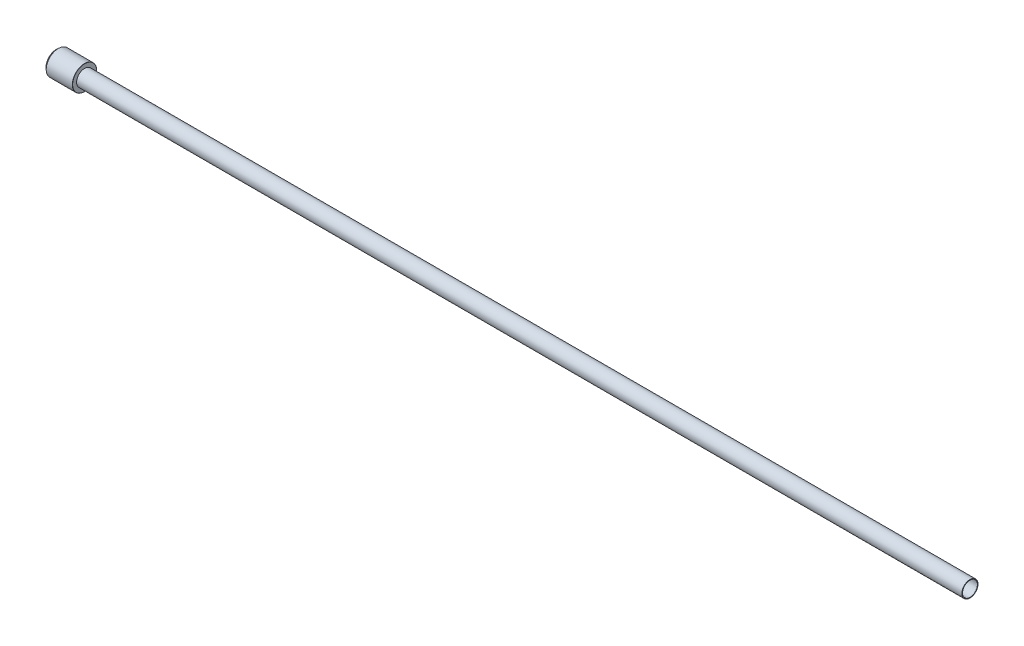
ISO-10303-21;
HEADER;
FILE_DESCRIPTION(('STEP AP214'),'2;1');
FILE_NAME('part.step','',(''),(''),'','','');
FILE_SCHEMA(('AUTOMOTIVE_DESIGN { 1 0 10303 214 1 1 1 1 }'));
ENDSEC;
DATA;
#1=APPLICATION_CONTEXT('core data for automotive mechanical design processes');
#2=APPLICATION_PROTOCOL_DEFINITION('international standard','automotive_design',2000,#1);
#3=PRODUCT_CONTEXT('',#1,'mechanical');
#4=PRODUCT('Part','Part','',(#3));
#5=PRODUCT_RELATED_PRODUCT_CATEGORY('part','',(#4));
#6=PRODUCT_DEFINITION_FORMATION('','',#4);
#7=PRODUCT_DEFINITION_CONTEXT('part definition',#1,'design');
#8=PRODUCT_DEFINITION('design','',#6,#7);
#9=PRODUCT_DEFINITION_SHAPE('','',#8);
#10=(LENGTH_UNIT() NAMED_UNIT(*) SI_UNIT(.MILLI.,.METRE.));
#11=(NAMED_UNIT(*) PLANE_ANGLE_UNIT() SI_UNIT($,.RADIAN.));
#12=(NAMED_UNIT(*) SI_UNIT($,.STERADIAN.) SOLID_ANGLE_UNIT());
#13=UNCERTAINTY_MEASURE_WITH_UNIT(LENGTH_MEASURE(1.E-05),#10,'distance_accuracy_value','');
#14=(GEOMETRIC_REPRESENTATION_CONTEXT(3) GLOBAL_UNCERTAINTY_ASSIGNED_CONTEXT((#13)) GLOBAL_UNIT_ASSIGNED_CONTEXT((#10,
#11,#12)) REPRESENTATION_CONTEXT('',''));
#15=CARTESIAN_POINT('',(0.,0.,0.));
#16=DIRECTION('',(0.,0.,1.));
#17=DIRECTION('',(1.,0.,0.));
#18=AXIS2_PLACEMENT_3D('',#15,#16,#17);
#19=CARTESIAN_POINT('',(14.,6.,0.));
#20=DIRECTION('',(-1.,0.,0.));
#21=DIRECTION('',(0.,0.,1.));
#22=AXIS2_PLACEMENT_3D('',#19,#20,#21);
#23=PLANE('',#22);
#24=CARTESIAN_POINT('',(14.,0.,0.));
#25=DIRECTION('',(-1.,0.,0.));
#26=DIRECTION('',(0.,0.,1.));
#27=AXIS2_PLACEMENT_3D('',#24,#25,#26);
#28=CIRCLE('',#27,5.9);
#29=CARTESIAN_POINT('',(14.,0.,5.9));
#30=VERTEX_POINT('',#29);
#31=EDGE_CURVE('E10',#30,#30,#28,.F.);
#32=ORIENTED_EDGE('',*,*,#31,.T.);
#33=EDGE_LOOP('',(#32));
#34=FACE_BOUND('',#33,.T.);
#35=CARTESIAN_POINT('',(14.,0.,0.));
#36=DIRECTION('',(-1.,0.,0.));
#37=DIRECTION('',(0.,0.,1.));
#38=AXIS2_PLACEMENT_3D('',#35,#36,#37);
#39=CIRCLE('',#38,3.9751);
#40=CARTESIAN_POINT('',(14.,0.,3.9751));
#41=VERTEX_POINT('',#40);
#42=EDGE_CURVE('E62',#41,#41,#39,.T.);
#43=ORIENTED_EDGE('',*,*,#42,.T.);
#44=EDGE_LOOP('',(#43));
#45=FACE_BOUND('',#44,.T.);
#46=ADVANCED_FACE('F30',(#34,#45),#23,.F.);
#47=CARTESIAN_POINT('',(-22.2121854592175,0.,0.));
#48=DIRECTION('',(-1.,0.,0.));
#49=DIRECTION('',(0.,0.,1.));
#50=AXIS2_PLACEMENT_3D('',#47,#48,#49);
#51=CYLINDRICAL_SURFACE('',#50,6.);
#52=CARTESIAN_POINT('',(13.9,0.,0.));
#53=DIRECTION('',(-1.,0.,0.));
#54=DIRECTION('',(0.,0.,1.));
#55=AXIS2_PLACEMENT_3D('',#52,#53,#54);
#56=CIRCLE('',#55,6.);
#57=CARTESIAN_POINT('',(13.9,0.,6.));
#58=VERTEX_POINT('',#57);
#59=EDGE_CURVE('E37',#58,#58,#56,.T.);
#60=ORIENTED_EDGE('',*,*,#59,.T.);
#61=EDGE_LOOP('',(#60));
#62=FACE_BOUND('',#61,.T.);
#63=CARTESIAN_POINT('',(1.064,0.,0.));
#64=DIRECTION('',(-1.,0.,0.));
#65=DIRECTION('',(0.,0.,1.));
#66=AXIS2_PLACEMENT_3D('',#63,#64,#65);
#67=CIRCLE('',#66,6.);
#68=CARTESIAN_POINT('',(1.064,0.,6.));
#69=VERTEX_POINT('',#68);
#70=EDGE_CURVE('E41',#69,#69,#67,.T.);
#71=ORIENTED_EDGE('',*,*,#70,.F.);
#72=EDGE_LOOP('',(#71));
#73=FACE_BOUND('',#72,.T.);
#74=ADVANCED_FACE('F100',(#62,#73),#51,.T.);
#75=CARTESIAN_POINT('',(1.064,0.,0.));
#76=DIRECTION('',(1.,0.,0.));
#77=DIRECTION('',(0.,0.,-1.));
#78=AXIS2_PLACEMENT_3D('',#75,#76,#77);
#79=CONICAL_SURFACE('',#78,6.,0.785398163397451);
#80=CARTESIAN_POINT('',(0.0999999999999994,0.,0.));
#81=DIRECTION('',(-1.,0.,0.));
#82=DIRECTION('',(0.,0.,1.));
#83=AXIS2_PLACEMENT_3D('',#80,#81,#82);
#84=CIRCLE('',#83,5.036);
#85=CARTESIAN_POINT('',(0.0999999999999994,0.,5.036));
#86=VERTEX_POINT('',#85);
#87=EDGE_CURVE('E45',#86,#86,#84,.T.);
#88=ORIENTED_EDGE('',*,*,#87,.F.);
#89=EDGE_LOOP('',(#88));
#90=FACE_BOUND('',#89,.T.);
#91=ORIENTED_EDGE('',*,*,#70,.T.);
#92=EDGE_LOOP('',(#91));
#93=FACE_BOUND('',#92,.T.);
#94=ADVANCED_FACE('F94',(#90,#93),#79,.T.);
#95=CARTESIAN_POINT('',(-22.2121854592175,0.,0.));
#96=DIRECTION('',(-1.,0.,0.));
#97=DIRECTION('',(0.,0.,1.));
#98=AXIS2_PLACEMENT_3D('',#95,#96,#97);
#99=CYLINDRICAL_SURFACE('',#98,5.036);
#100=CARTESIAN_POINT('',(0.,0.,0.));
#101=DIRECTION('',(-1.,0.,0.));
#102=DIRECTION('',(0.,0.,1.));
#103=AXIS2_PLACEMENT_3D('',#100,#101,#102);
#104=CIRCLE('',#103,5.036);
#105=CARTESIAN_POINT('',(0.,0.,5.036));
#106=VERTEX_POINT('',#105);
#107=EDGE_CURVE('E50',#106,#106,#104,.T.);
#108=ORIENTED_EDGE('',*,*,#107,.F.);
#109=EDGE_LOOP('',(#108));
#110=FACE_BOUND('',#109,.T.);
#111=ORIENTED_EDGE('',*,*,#87,.T.);
#112=EDGE_LOOP('',(#111));
#113=FACE_BOUND('',#112,.T.);
#114=ADVANCED_FACE('F88',(#110,#113),#99,.T.);
#115=CARTESIAN_POINT('',(0.,3.6576,0.));
#116=DIRECTION('',(1.,0.,0.));
#117=DIRECTION('',(0.,0.,-1.));
#118=AXIS2_PLACEMENT_3D('',#115,#116,#117);
#119=PLANE('',#118);
#120=CARTESIAN_POINT('',(0.,0.,0.));
#121=DIRECTION('',(-1.,0.,0.));
#122=DIRECTION('',(0.,0.,1.));
#123=AXIS2_PLACEMENT_3D('',#120,#121,#122);
#124=CIRCLE('',#123,3.6576);
#125=CARTESIAN_POINT('',(0.,0.,3.6576));
#126=VERTEX_POINT('',#125);
#127=EDGE_CURVE('E53',#126,#126,#124,.T.);
#128=ORIENTED_EDGE('',*,*,#127,.F.);
#129=EDGE_LOOP('',(#128));
#130=FACE_BOUND('',#129,.T.);
#131=ORIENTED_EDGE('',*,*,#107,.T.);
#132=EDGE_LOOP('',(#131));
#133=FACE_BOUND('',#132,.T.);
#134=ADVANCED_FACE('F82',(#130,#133),#119,.F.);
#135=CARTESIAN_POINT('',(-22.2121854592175,0.,0.));
#136=DIRECTION('',(-1.,0.,0.));
#137=DIRECTION('',(0.,0.,1.));
#138=AXIS2_PLACEMENT_3D('',#135,#136,#137);
#139=CYLINDRICAL_SURFACE('',#138,3.65760000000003);
#140=CARTESIAN_POINT('',(450.,0.,0.));
#141=DIRECTION('',(-1.,0.,0.));
#142=DIRECTION('',(0.,0.,1.));
#143=AXIS2_PLACEMENT_3D('',#140,#141,#142);
#144=CIRCLE('',#143,3.65760000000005);
#145=CARTESIAN_POINT('',(450.,0.,3.65760000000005));
#146=VERTEX_POINT('',#145);
#147=EDGE_CURVE('E56',#146,#146,#144,.T.);
#148=ORIENTED_EDGE('',*,*,#147,.F.);
#149=EDGE_LOOP('',(#148));
#150=FACE_BOUND('',#149,.T.);
#151=ORIENTED_EDGE('',*,*,#127,.T.);
#152=EDGE_LOOP('',(#151));
#153=FACE_BOUND('',#152,.T.);
#154=ADVANCED_FACE('F76',(#150,#153),#139,.F.);
#155=CARTESIAN_POINT('',(450.,3.9751,0.));
#156=DIRECTION('',(-1.,0.,0.));
#157=DIRECTION('',(0.,0.,1.));
#158=AXIS2_PLACEMENT_3D('',#155,#156,#157);
#159=PLANE('',#158);
#160=CARTESIAN_POINT('',(450.,0.,0.));
#161=DIRECTION('',(-1.,0.,0.));
#162=DIRECTION('',(0.,0.,1.));
#163=AXIS2_PLACEMENT_3D('',#160,#161,#162);
#164=CIRCLE('',#163,3.9751);
#165=CARTESIAN_POINT('',(450.,0.,3.9751));
#166=VERTEX_POINT('',#165);
#167=EDGE_CURVE('E59',#166,#166,#164,.T.);
#168=ORIENTED_EDGE('',*,*,#167,.F.);
#169=EDGE_LOOP('',(#168));
#170=FACE_BOUND('',#169,.T.);
#171=ORIENTED_EDGE('',*,*,#147,.T.);
#172=EDGE_LOOP('',(#171));
#173=FACE_BOUND('',#172,.T.);
#174=ADVANCED_FACE('F70',(#170,#173),#159,.F.);
#175=CARTESIAN_POINT('',(-22.2121854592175,0.,0.));
#176=DIRECTION('',(-1.,0.,0.));
#177=DIRECTION('',(0.,0.,1.));
#178=AXIS2_PLACEMENT_3D('',#175,#176,#177);
#179=CYLINDRICAL_SURFACE('',#178,3.9751);
#180=ORIENTED_EDGE('',*,*,#42,.F.);
#181=EDGE_LOOP('',(#180));
#182=FACE_BOUND('',#181,.T.);
#183=ORIENTED_EDGE('',*,*,#167,.T.);
#184=EDGE_LOOP('',(#183));
#185=FACE_BOUND('',#184,.T.);
#186=ADVANCED_FACE('F67',(#182,#185),#179,.T.);
#187=CARTESIAN_POINT('',(13.9,0.,0.));
#188=DIRECTION('',(-1.,0.,0.));
#189=DIRECTION('',(0.,0.,1.));
#190=AXIS2_PLACEMENT_3D('',#187,#188,#189);
#191=TOROIDAL_SURFACE('',#190,5.9,0.1);
#192=ORIENTED_EDGE('',*,*,#31,.F.);
#193=EDGE_LOOP('',(#192));
#194=FACE_BOUND('',#193,.T.);
#195=ORIENTED_EDGE('',*,*,#59,.F.);
#196=EDGE_LOOP('',(#195));
#197=FACE_BOUND('',#196,.T.);
#198=ADVANCED_FACE('F32',(#194,#197),#191,.T.);
#199=CLOSED_SHELL('',(#46,#74,#94,#114,#134,#154,#174,#186,#198));
#200=MANIFOLD_SOLID_BREP('B2',#199);
#201=ADVANCED_BREP_SHAPE_REPRESENTATION('',(#18,#200),#14);
#202=SHAPE_DEFINITION_REPRESENTATION(#9,#201);
ENDSEC;
END-ISO-10303-21;
